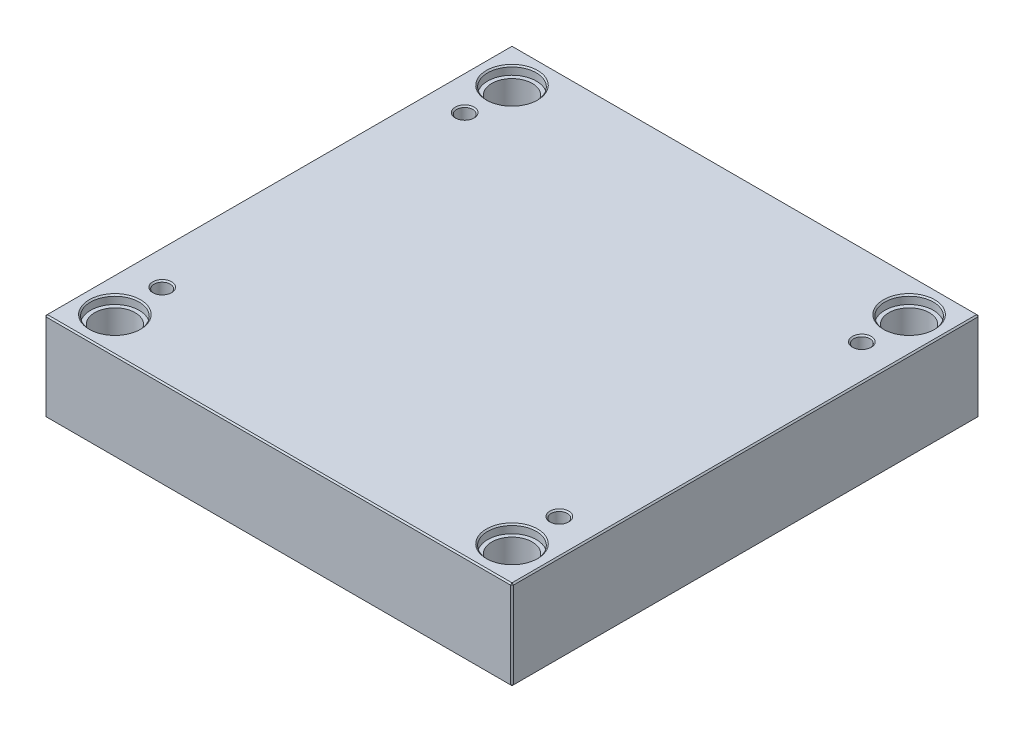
ISO-10303-21;
HEADER;
FILE_DESCRIPTION(('STEP AP214'),'2;1');
FILE_NAME('part.step','',(''),(''),'','','');
FILE_SCHEMA(('AUTOMOTIVE_DESIGN { 1 0 10303 214 1 1 1 1 }'));
ENDSEC;
DATA;
#1=APPLICATION_CONTEXT('core data for automotive mechanical design processes');
#2=APPLICATION_PROTOCOL_DEFINITION('international standard','automotive_design',2000,#1);
#3=PRODUCT_CONTEXT('',#1,'mechanical');
#4=PRODUCT('Part','Part','',(#3));
#5=PRODUCT_RELATED_PRODUCT_CATEGORY('part','',(#4));
#6=PRODUCT_DEFINITION_FORMATION('','',#4);
#7=PRODUCT_DEFINITION_CONTEXT('part definition',#1,'design');
#8=PRODUCT_DEFINITION('design','',#6,#7);
#9=PRODUCT_DEFINITION_SHAPE('','',#8);
#10=(LENGTH_UNIT() NAMED_UNIT(*) SI_UNIT(.MILLI.,.METRE.));
#11=(NAMED_UNIT(*) PLANE_ANGLE_UNIT() SI_UNIT($,.RADIAN.));
#12=(NAMED_UNIT(*) SI_UNIT($,.STERADIAN.) SOLID_ANGLE_UNIT());
#13=UNCERTAINTY_MEASURE_WITH_UNIT(LENGTH_MEASURE(1.E-05),#10,'distance_accuracy_value','');
#14=(GEOMETRIC_REPRESENTATION_CONTEXT(3) GLOBAL_UNCERTAINTY_ASSIGNED_CONTEXT((#13)) GLOBAL_UNIT_ASSIGNED_CONTEXT((#10,
#11,#12)) REPRESENTATION_CONTEXT('',''));
#15=CARTESIAN_POINT('',(0.,0.,0.));
#16=DIRECTION('',(0.,0.,1.));
#17=DIRECTION('',(1.,0.,0.));
#18=AXIS2_PLACEMENT_3D('',#15,#16,#17);
#19=CARTESIAN_POINT('',(-147.,0.,-147.));
#20=DIRECTION('',(0.,1.,0.));
#21=DIRECTION('',(0.,0.,1.));
#22=AXIS2_PLACEMENT_3D('',#19,#20,#21);
#23=CYLINDRICAL_SURFACE('',#22,15.);
#24=CARTESIAN_POINT('',(-147.,0.999999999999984,-147.));
#25=DIRECTION('',(0.,1.,0.));
#26=DIRECTION('',(0.,0.,1.));
#27=AXIS2_PLACEMENT_3D('',#24,#25,#26);
#28=CIRCLE('',#27,15.);
#29=CARTESIAN_POINT('',(-147.,0.999999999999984,-132.));
#30=VERTEX_POINT('',#29);
#31=EDGE_CURVE('E472',#30,#30,#28,.F.);
#32=ORIENTED_EDGE('',*,*,#31,.T.);
#33=EDGE_LOOP('',(#32));
#34=FACE_BOUND('',#33,.T.);
#35=CARTESIAN_POINT('',(-147.,59.7,-147.));
#36=DIRECTION('',(0.,1.,0.));
#37=DIRECTION('',(0.,0.,1.));
#38=AXIS2_PLACEMENT_3D('',#35,#36,#37);
#39=CIRCLE('',#38,15.);
#40=CARTESIAN_POINT('',(-147.,59.7,-132.));
#41=VERTEX_POINT('',#40);
#42=EDGE_CURVE('E221',#41,#41,#39,.F.);
#43=ORIENTED_EDGE('',*,*,#42,.F.);
#44=EDGE_LOOP('',(#43));
#45=FACE_BOUND('',#44,.T.);
#46=ADVANCED_FACE('F16',(#34,#45),#23,.F.);
#47=CARTESIAN_POINT('',(147.,0.,-147.));
#48=DIRECTION('',(0.,1.,0.));
#49=DIRECTION('',(0.,0.,1.));
#50=AXIS2_PLACEMENT_3D('',#47,#48,#49);
#51=CYLINDRICAL_SURFACE('',#50,15.);
#52=CARTESIAN_POINT('',(147.,0.999999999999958,-147.));
#53=DIRECTION('',(0.,1.,0.));
#54=DIRECTION('',(0.,0.,1.));
#55=AXIS2_PLACEMENT_3D('',#52,#53,#54);
#56=CIRCLE('',#55,15.);
#57=CARTESIAN_POINT('',(147.,0.999999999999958,-132.));
#58=VERTEX_POINT('',#57);
#59=EDGE_CURVE('E474',#58,#58,#56,.F.);
#60=ORIENTED_EDGE('',*,*,#59,.T.);
#61=EDGE_LOOP('',(#60));
#62=FACE_BOUND('',#61,.T.);
#63=CARTESIAN_POINT('',(147.,59.7,-147.));
#64=DIRECTION('',(0.,1.,0.));
#65=DIRECTION('',(0.,0.,1.));
#66=AXIS2_PLACEMENT_3D('',#63,#64,#65);
#67=CIRCLE('',#66,15.);
#68=CARTESIAN_POINT('',(147.,59.7,-132.));
#69=VERTEX_POINT('',#68);
#70=EDGE_CURVE('E218',#69,#69,#67,.F.);
#71=ORIENTED_EDGE('',*,*,#70,.F.);
#72=EDGE_LOOP('',(#71));
#73=FACE_BOUND('',#72,.T.);
#74=ADVANCED_FACE('F263',(#62,#73),#51,.F.);
#75=CARTESIAN_POINT('',(147.,0.,147.));
#76=DIRECTION('',(0.,1.,0.));
#77=DIRECTION('',(0.,0.,1.));
#78=AXIS2_PLACEMENT_3D('',#75,#76,#77);
#79=CYLINDRICAL_SURFACE('',#78,15.);
#80=CARTESIAN_POINT('',(147.,0.999999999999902,147.));
#81=DIRECTION('',(0.,1.,0.));
#82=DIRECTION('',(0.,0.,1.));
#83=AXIS2_PLACEMENT_3D('',#80,#81,#82);
#84=CIRCLE('',#83,15.);
#85=CARTESIAN_POINT('',(147.,0.999999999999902,162.));
#86=VERTEX_POINT('',#85);
#87=EDGE_CURVE('E477',#86,#86,#84,.F.);
#88=ORIENTED_EDGE('',*,*,#87,.T.);
#89=EDGE_LOOP('',(#88));
#90=FACE_BOUND('',#89,.T.);
#91=CARTESIAN_POINT('',(147.,59.7,147.));
#92=DIRECTION('',(0.,1.,0.));
#93=DIRECTION('',(0.,0.,1.));
#94=AXIS2_PLACEMENT_3D('',#91,#92,#93);
#95=CIRCLE('',#94,15.);
#96=CARTESIAN_POINT('',(147.,59.7,162.));
#97=VERTEX_POINT('',#96);
#98=EDGE_CURVE('E214',#97,#97,#95,.F.);
#99=ORIENTED_EDGE('',*,*,#98,.F.);
#100=EDGE_LOOP('',(#99));
#101=FACE_BOUND('',#100,.T.);
#102=ADVANCED_FACE('F270',(#90,#101),#79,.F.);
#103=CARTESIAN_POINT('',(-147.,0.,147.));
#104=DIRECTION('',(0.,1.,0.));
#105=DIRECTION('',(0.,0.,1.));
#106=AXIS2_PLACEMENT_3D('',#103,#104,#105);
#107=CYLINDRICAL_SURFACE('',#106,15.);
#108=CARTESIAN_POINT('',(-147.,0.999999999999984,147.));
#109=DIRECTION('',(0.,1.,0.));
#110=DIRECTION('',(0.,0.,1.));
#111=AXIS2_PLACEMENT_3D('',#108,#109,#110);
#112=CIRCLE('',#111,15.);
#113=CARTESIAN_POINT('',(-147.,0.999999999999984,162.));
#114=VERTEX_POINT('',#113);
#115=EDGE_CURVE('E480',#114,#114,#112,.F.);
#116=ORIENTED_EDGE('',*,*,#115,.T.);
#117=EDGE_LOOP('',(#116));
#118=FACE_BOUND('',#117,.T.);
#119=CARTESIAN_POINT('',(-147.,59.7,147.));
#120=DIRECTION('',(0.,1.,0.));
#121=DIRECTION('',(0.,0.,1.));
#122=AXIS2_PLACEMENT_3D('',#119,#120,#121);
#123=CIRCLE('',#122,15.);
#124=CARTESIAN_POINT('',(-147.,59.7,162.));
#125=VERTEX_POINT('',#124);
#126=EDGE_CURVE('E211',#125,#125,#123,.F.);
#127=ORIENTED_EDGE('',*,*,#126,.F.);
#128=EDGE_LOOP('',(#127));
#129=FACE_BOUND('',#128,.T.);
#130=ADVANCED_FACE('F277',(#118,#129),#107,.F.);
#131=CARTESIAN_POINT('',(-173.,66.,173.));
#132=DIRECTION('',(1.,0.,0.));
#133=DIRECTION('',(0.,0.,-1.));
#134=AXIS2_PLACEMENT_3D('',#131,#132,#133);
#135=PLANE('',#134);
#136=DIRECTION('',(0.,-1.,0.));
#137=VECTOR('',#136,1.);
#138=CARTESIAN_POINT('',(-173.,66.,-172.));
#139=LINE('',#138,#137);
#140=CARTESIAN_POINT('',(-173.,65.,-172.));
#141=VERTEX_POINT('',#140);
#142=CARTESIAN_POINT('',(-173.,1.,-172.));
#143=VERTEX_POINT('',#142);
#144=EDGE_CURVE('E487',#141,#143,#139,.T.);
#145=ORIENTED_EDGE('',*,*,#144,.T.);
#146=DIRECTION('',(0.,0.,1.));
#147=VECTOR('',#146,1.);
#148=CARTESIAN_POINT('',(-173.,1.,173.));
#149=LINE('',#148,#147);
#150=CARTESIAN_POINT('',(-173.,1.,172.));
#151=VERTEX_POINT('',#150);
#152=EDGE_CURVE('E490',#143,#151,#149,.T.);
#153=ORIENTED_EDGE('',*,*,#152,.T.);
#154=DIRECTION('',(0.,1.,0.));
#155=VECTOR('',#154,1.);
#156=CARTESIAN_POINT('',(-173.,66.,172.));
#157=LINE('',#156,#155);
#158=CARTESIAN_POINT('',(-173.,65.,172.));
#159=VERTEX_POINT('',#158);
#160=EDGE_CURVE('E485',#151,#159,#157,.T.);
#161=ORIENTED_EDGE('',*,*,#160,.T.);
#162=DIRECTION('',(0.,0.,-1.));
#163=VECTOR('',#162,1.);
#164=CARTESIAN_POINT('',(-173.,65.,-173.));
#165=LINE('',#164,#163);
#166=EDGE_CURVE('E483',#159,#141,#165,.T.);
#167=ORIENTED_EDGE('',*,*,#166,.T.);
#168=EDGE_LOOP('',(#145,#153,#161,#167));
#169=FACE_BOUND('',#168,.T.);
#170=ADVANCED_FACE('F298',(#169),#135,.F.);
#171=CARTESIAN_POINT('',(173.,66.,173.));
#172=DIRECTION('',(0.,0.,-1.));
#173=DIRECTION('',(-1.,0.,0.));
#174=AXIS2_PLACEMENT_3D('',#171,#172,#173);
#175=PLANE('',#174);
#176=DIRECTION('',(-1.,0.,0.));
#177=VECTOR('',#176,1.);
#178=CARTESIAN_POINT('',(-173.,65.,173.));
#179=LINE('',#178,#177);
#180=CARTESIAN_POINT('',(172.,65.,173.));
#181=VERTEX_POINT('',#180);
#182=CARTESIAN_POINT('',(-172.,65.,173.));
#183=VERTEX_POINT('',#182);
#184=EDGE_CURVE('E509',#181,#183,#179,.T.);
#185=ORIENTED_EDGE('',*,*,#184,.T.);
#186=DIRECTION('',(0.,-1.,0.));
#187=VECTOR('',#186,1.);
#188=CARTESIAN_POINT('',(-172.,66.,173.));
#189=LINE('',#188,#187);
#190=CARTESIAN_POINT('',(-172.,1.,173.));
#191=VERTEX_POINT('',#190);
#192=EDGE_CURVE('E515',#183,#191,#189,.T.);
#193=ORIENTED_EDGE('',*,*,#192,.T.);
#194=DIRECTION('',(1.,0.,0.));
#195=VECTOR('',#194,1.);
#196=CARTESIAN_POINT('',(173.,1.,173.));
#197=LINE('',#196,#195);
#198=CARTESIAN_POINT('',(172.,1.,173.));
#199=VERTEX_POINT('',#198);
#200=EDGE_CURVE('E513',#191,#199,#197,.T.);
#201=ORIENTED_EDGE('',*,*,#200,.T.);
#202=DIRECTION('',(0.,1.,0.));
#203=VECTOR('',#202,1.);
#204=CARTESIAN_POINT('',(172.,66.,173.));
#205=LINE('',#204,#203);
#206=EDGE_CURVE('E511',#199,#181,#205,.T.);
#207=ORIENTED_EDGE('',*,*,#206,.T.);
#208=EDGE_LOOP('',(#185,#193,#201,#207));
#209=FACE_BOUND('',#208,.T.);
#210=ADVANCED_FACE('F294',(#209),#175,.F.);
#211=CARTESIAN_POINT('',(173.,66.,173.));
#212=DIRECTION('',(-1.,0.,0.));
#213=DIRECTION('',(0.,0.,1.));
#214=AXIS2_PLACEMENT_3D('',#211,#212,#213);
#215=PLANE('',#214);
#216=DIRECTION('',(0.,0.,-1.));
#217=VECTOR('',#216,1.);
#218=CARTESIAN_POINT('',(173.,1.,173.));
#219=LINE('',#218,#217);
#220=CARTESIAN_POINT('',(173.,1.,172.));
#221=VERTEX_POINT('',#220);
#222=CARTESIAN_POINT('',(173.,1.,-172.));
#223=VERTEX_POINT('',#222);
#224=EDGE_CURVE('E504',#221,#223,#219,.T.);
#225=ORIENTED_EDGE('',*,*,#224,.T.);
#226=DIRECTION('',(0.,1.,0.));
#227=VECTOR('',#226,1.);
#228=CARTESIAN_POINT('',(173.,66.,-172.));
#229=LINE('',#228,#227);
#230=CARTESIAN_POINT('',(173.,65.,-172.));
#231=VERTEX_POINT('',#230);
#232=EDGE_CURVE('E506',#223,#231,#229,.T.);
#233=ORIENTED_EDGE('',*,*,#232,.T.);
#234=DIRECTION('',(0.,0.,1.));
#235=VECTOR('',#234,1.);
#236=CARTESIAN_POINT('',(173.,65.,173.));
#237=LINE('',#236,#235);
#238=CARTESIAN_POINT('',(173.,65.,172.));
#239=VERTEX_POINT('',#238);
#240=EDGE_CURVE('E500',#231,#239,#237,.T.);
#241=ORIENTED_EDGE('',*,*,#240,.T.);
#242=DIRECTION('',(0.,-1.,0.));
#243=VECTOR('',#242,1.);
#244=CARTESIAN_POINT('',(173.,66.,172.));
#245=LINE('',#244,#243);
#246=EDGE_CURVE('E502',#239,#221,#245,.T.);
#247=ORIENTED_EDGE('',*,*,#246,.T.);
#248=EDGE_LOOP('',(#225,#233,#241,#247));
#249=FACE_BOUND('',#248,.T.);
#250=ADVANCED_FACE('F290',(#249),#215,.F.);
#251=CARTESIAN_POINT('',(173.,66.,-173.));
#252=DIRECTION('',(0.,0.,1.));
#253=DIRECTION('',(1.,0.,0.));
#254=AXIS2_PLACEMENT_3D('',#251,#252,#253);
#255=PLANE('',#254);
#256=DIRECTION('',(0.,-1.,0.));
#257=VECTOR('',#256,1.);
#258=CARTESIAN_POINT('',(172.,66.,-173.));
#259=LINE('',#258,#257);
#260=CARTESIAN_POINT('',(172.,65.,-173.));
#261=VERTEX_POINT('',#260);
#262=CARTESIAN_POINT('',(172.,1.,-173.));
#263=VERTEX_POINT('',#262);
#264=EDGE_CURVE('E494',#261,#263,#259,.T.);
#265=ORIENTED_EDGE('',*,*,#264,.T.);
#266=DIRECTION('',(-1.,0.,0.));
#267=VECTOR('',#266,1.);
#268=CARTESIAN_POINT('',(173.,1.,-173.));
#269=LINE('',#268,#267);
#270=CARTESIAN_POINT('',(-172.,1.,-173.));
#271=VERTEX_POINT('',#270);
#272=EDGE_CURVE('E138',#263,#271,#269,.T.);
#273=ORIENTED_EDGE('',*,*,#272,.T.);
#274=DIRECTION('',(0.,1.,0.));
#275=VECTOR('',#274,1.);
#276=CARTESIAN_POINT('',(-172.,66.,-173.));
#277=LINE('',#276,#275);
#278=CARTESIAN_POINT('',(-172.,65.,-173.));
#279=VERTEX_POINT('',#278);
#280=EDGE_CURVE('E496',#271,#279,#277,.T.);
#281=ORIENTED_EDGE('',*,*,#280,.T.);
#282=DIRECTION('',(1.,0.,0.));
#283=VECTOR('',#282,1.);
#284=CARTESIAN_POINT('',(173.,65.,-173.));
#285=LINE('',#284,#283);
#286=EDGE_CURVE('E492',#279,#261,#285,.T.);
#287=ORIENTED_EDGE('',*,*,#286,.T.);
#288=EDGE_LOOP('',(#265,#273,#281,#287));
#289=FACE_BOUND('',#288,.T.);
#290=ADVANCED_FACE('F282',(#289),#255,.F.);
#291=CARTESIAN_POINT('',(0.,66.,0.));
#292=DIRECTION('',(0.,1.,0.));
#293=DIRECTION('',(0.,0.,1.));
#294=AXIS2_PLACEMENT_3D('',#291,#292,#293);
#295=PLANE('',#294);
#296=CARTESIAN_POINT('',(147.,66.,147.));
#297=DIRECTION('',(0.,1.,0.));
#298=DIRECTION('',(0.,0.,1.));
#299=AXIS2_PLACEMENT_3D('',#296,#297,#298);
#300=CIRCLE('',#299,19.);
#301=CARTESIAN_POINT('',(147.,66.,166.));
#302=VERTEX_POINT('',#301);
#303=EDGE_CURVE('E236',#302,#302,#300,.F.);
#304=ORIENTED_EDGE('',*,*,#303,.T.);
#305=EDGE_LOOP('',(#304));
#306=FACE_BOUND('',#305,.T.);
#307=CARTESIAN_POINT('',(-147.,66.,147.));
#308=DIRECTION('',(0.,1.,0.));
#309=DIRECTION('',(0.,0.,1.));
#310=AXIS2_PLACEMENT_3D('',#307,#308,#309);
#311=CIRCLE('',#310,19.);
#312=CARTESIAN_POINT('',(-147.,66.,166.));
#313=VERTEX_POINT('',#312);
#314=EDGE_CURVE('E233',#313,#313,#311,.F.);
#315=ORIENTED_EDGE('',*,*,#314,.T.);
#316=EDGE_LOOP('',(#315));
#317=FACE_BOUND('',#316,.T.);
#318=CARTESIAN_POINT('',(147.,66.,-147.));
#319=DIRECTION('',(0.,1.,0.));
#320=DIRECTION('',(0.,0.,1.));
#321=AXIS2_PLACEMENT_3D('',#318,#319,#320);
#322=CIRCLE('',#321,19.);
#323=CARTESIAN_POINT('',(147.,66.,-128.));
#324=VERTEX_POINT('',#323);
#325=EDGE_CURVE('E230',#324,#324,#322,.F.);
#326=ORIENTED_EDGE('',*,*,#325,.T.);
#327=EDGE_LOOP('',(#326));
#328=FACE_BOUND('',#327,.T.);
#329=CARTESIAN_POINT('',(-147.,66.,-147.));
#330=DIRECTION('',(0.,1.,0.));
#331=DIRECTION('',(0.,0.,1.));
#332=AXIS2_PLACEMENT_3D('',#329,#330,#331);
#333=CIRCLE('',#332,19.);
#334=CARTESIAN_POINT('',(-147.,66.,-128.));
#335=VERTEX_POINT('',#334);
#336=EDGE_CURVE('E227',#335,#335,#333,.F.);
#337=ORIENTED_EDGE('',*,*,#336,.T.);
#338=EDGE_LOOP('',(#337));
#339=FACE_BOUND('',#338,.T.);
#340=CARTESIAN_POINT('',(-147.,66.,112.));
#341=DIRECTION('',(0.,1.,0.));
#342=DIRECTION('',(0.,0.,1.));
#343=AXIS2_PLACEMENT_3D('',#340,#341,#342);
#344=CIRCLE('',#343,7.);
#345=CARTESIAN_POINT('',(-147.,66.,119.));
#346=VERTEX_POINT('',#345);
#347=EDGE_CURVE('E198',#346,#346,#344,.F.);
#348=ORIENTED_EDGE('',*,*,#347,.T.);
#349=EDGE_LOOP('',(#348));
#350=FACE_BOUND('',#349,.T.);
#351=CARTESIAN_POINT('',(147.,66.,112.));
#352=DIRECTION('',(0.,1.,0.));
#353=DIRECTION('',(0.,0.,1.));
#354=AXIS2_PLACEMENT_3D('',#351,#352,#353);
#355=CIRCLE('',#354,7.);
#356=CARTESIAN_POINT('',(147.,66.,119.));
#357=VERTEX_POINT('',#356);
#358=EDGE_CURVE('E195',#357,#357,#355,.F.);
#359=ORIENTED_EDGE('',*,*,#358,.T.);
#360=EDGE_LOOP('',(#359));
#361=FACE_BOUND('',#360,.T.);
#362=CARTESIAN_POINT('',(147.,66.,-112.));
#363=DIRECTION('',(0.,1.,0.));
#364=DIRECTION('',(0.,0.,1.));
#365=AXIS2_PLACEMENT_3D('',#362,#363,#364);
#366=CIRCLE('',#365,7.);
#367=CARTESIAN_POINT('',(147.,66.,-105.));
#368=VERTEX_POINT('',#367);
#369=EDGE_CURVE('E192',#368,#368,#366,.F.);
#370=ORIENTED_EDGE('',*,*,#369,.T.);
#371=EDGE_LOOP('',(#370));
#372=FACE_BOUND('',#371,.T.);
#373=CARTESIAN_POINT('',(-147.,66.,-112.));
#374=DIRECTION('',(0.,1.,0.));
#375=DIRECTION('',(0.,0.,1.));
#376=AXIS2_PLACEMENT_3D('',#373,#374,#375);
#377=CIRCLE('',#376,7.);
#378=CARTESIAN_POINT('',(-147.,66.,-105.));
#379=VERTEX_POINT('',#378);
#380=EDGE_CURVE('E188',#379,#379,#377,.F.);
#381=ORIENTED_EDGE('',*,*,#380,.T.);
#382=EDGE_LOOP('',(#381));
#383=FACE_BOUND('',#382,.T.);
#384=DIRECTION('',(0.,0.,-1.));
#385=VECTOR('',#384,1.);
#386=CARTESIAN_POINT('',(172.,66.,-173.));
#387=LINE('',#386,#385);
#388=CARTESIAN_POINT('',(172.,66.,172.));
#389=VERTEX_POINT('',#388);
#390=CARTESIAN_POINT('',(172.,66.,-172.));
#391=VERTEX_POINT('',#390);
#392=EDGE_CURVE('E31',#389,#391,#387,.T.);
#393=ORIENTED_EDGE('',*,*,#392,.T.);
#394=DIRECTION('',(-1.,0.,0.));
#395=VECTOR('',#394,1.);
#396=CARTESIAN_POINT('',(-173.,66.,-172.));
#397=LINE('',#396,#395);
#398=CARTESIAN_POINT('',(-172.,66.,-172.));
#399=VERTEX_POINT('',#398);
#400=EDGE_CURVE('E189',#391,#399,#397,.T.);
#401=ORIENTED_EDGE('',*,*,#400,.T.);
#402=DIRECTION('',(0.,0.,1.));
#403=VECTOR('',#402,1.);
#404=CARTESIAN_POINT('',(-172.,66.,173.));
#405=LINE('',#404,#403);
#406=CARTESIAN_POINT('',(-172.,66.,172.));
#407=VERTEX_POINT('',#406);
#408=EDGE_CURVE('E518',#399,#407,#405,.T.);
#409=ORIENTED_EDGE('',*,*,#408,.T.);
#410=DIRECTION('',(1.,0.,0.));
#411=VECTOR('',#410,1.);
#412=CARTESIAN_POINT('',(173.,66.,172.));
#413=LINE('',#412,#411);
#414=EDGE_CURVE('E36',#407,#389,#413,.T.);
#415=ORIENTED_EDGE('',*,*,#414,.T.);
#416=EDGE_LOOP('',(#393,#401,#409,#415));
#417=FACE_BOUND('',#416,.T.);
#418=ADVANCED_FACE('F279',(#306,#317,#328,#339,#350,#361,#372,#383,#417),#295,.T.);
#419=CARTESIAN_POINT('',(0.,0.,0.));
#420=DIRECTION('',(0.,1.,0.));
#421=DIRECTION('',(0.,0.,1.));
#422=AXIS2_PLACEMENT_3D('',#419,#420,#421);
#423=PLANE('',#422);
#424=CARTESIAN_POINT('',(-147.,0.,-147.));
#425=DIRECTION('',(0.,1.,0.));
#426=DIRECTION('',(0.,0.,1.));
#427=AXIS2_PLACEMENT_3D('',#424,#425,#426);
#428=CIRCLE('',#427,16.);
#429=CARTESIAN_POINT('',(-147.,0.,-131.));
#430=VERTEX_POINT('',#429);
#431=EDGE_CURVE('E469',#430,#430,#428,.T.);
#432=ORIENTED_EDGE('',*,*,#431,.T.);
#433=EDGE_LOOP('',(#432));
#434=FACE_BOUND('',#433,.T.);
#435=CARTESIAN_POINT('',(147.,0.,-147.));
#436=DIRECTION('',(0.,1.,0.));
#437=DIRECTION('',(0.,0.,1.));
#438=AXIS2_PLACEMENT_3D('',#435,#436,#437);
#439=CIRCLE('',#438,16.);
#440=CARTESIAN_POINT('',(147.,0.,-131.));
#441=VERTEX_POINT('',#440);
#442=EDGE_CURVE('E466',#441,#441,#439,.T.);
#443=ORIENTED_EDGE('',*,*,#442,.T.);
#444=EDGE_LOOP('',(#443));
#445=FACE_BOUND('',#444,.T.);
#446=CARTESIAN_POINT('',(147.,0.,147.));
#447=DIRECTION('',(0.,1.,0.));
#448=DIRECTION('',(0.,0.,1.));
#449=AXIS2_PLACEMENT_3D('',#446,#447,#448);
#450=CIRCLE('',#449,16.);
#451=CARTESIAN_POINT('',(147.,0.,163.));
#452=VERTEX_POINT('',#451);
#453=EDGE_CURVE('E463',#452,#452,#450,.T.);
#454=ORIENTED_EDGE('',*,*,#453,.T.);
#455=EDGE_LOOP('',(#454));
#456=FACE_BOUND('',#455,.T.);
#457=CARTESIAN_POINT('',(-147.,0.,147.));
#458=DIRECTION('',(0.,1.,0.));
#459=DIRECTION('',(0.,0.,1.));
#460=AXIS2_PLACEMENT_3D('',#457,#458,#459);
#461=CIRCLE('',#460,16.);
#462=CARTESIAN_POINT('',(-147.,0.,163.));
#463=VERTEX_POINT('',#462);
#464=EDGE_CURVE('E460',#463,#463,#461,.T.);
#465=ORIENTED_EDGE('',*,*,#464,.T.);
#466=EDGE_LOOP('',(#465));
#467=FACE_BOUND('',#466,.T.);
#468=DIRECTION('',(0.,0.,1.));
#469=VECTOR('',#468,1.);
#470=CARTESIAN_POINT('',(172.,0.,0.));
#471=LINE('',#470,#469);
#472=CARTESIAN_POINT('',(172.,0.,-172.));
#473=VERTEX_POINT('',#472);
#474=CARTESIAN_POINT('',(172.,0.,172.));
#475=VERTEX_POINT('',#474);
#476=EDGE_CURVE('E108',#473,#475,#471,.T.);
#477=ORIENTED_EDGE('',*,*,#476,.T.);
#478=DIRECTION('',(-1.,0.,0.));
#479=VECTOR('',#478,1.);
#480=CARTESIAN_POINT('',(0.,0.,172.));
#481=LINE('',#480,#479);
#482=CARTESIAN_POINT('',(-172.,0.,172.));
#483=VERTEX_POINT('',#482);
#484=EDGE_CURVE('E458',#475,#483,#481,.T.);
#485=ORIENTED_EDGE('',*,*,#484,.T.);
#486=DIRECTION('',(0.,0.,-1.));
#487=VECTOR('',#486,1.);
#488=CARTESIAN_POINT('',(-172.,0.,0.));
#489=LINE('',#488,#487);
#490=CARTESIAN_POINT('',(-172.,0.,-172.));
#491=VERTEX_POINT('',#490);
#492=EDGE_CURVE('E110',#483,#491,#489,.T.);
#493=ORIENTED_EDGE('',*,*,#492,.T.);
#494=DIRECTION('',(1.,0.,0.));
#495=VECTOR('',#494,1.);
#496=CARTESIAN_POINT('',(0.,0.,-172.));
#497=LINE('',#496,#495);
#498=EDGE_CURVE('E104',#491,#473,#497,.T.);
#499=ORIENTED_EDGE('',*,*,#498,.T.);
#500=EDGE_LOOP('',(#477,#485,#493,#499));
#501=FACE_BOUND('',#500,.T.);
#502=ADVANCED_FACE('F106',(#434,#445,#456,#467,#501),#423,.F.);
#503=CARTESIAN_POINT('',(-147.,0.,-147.));
#504=DIRECTION('',(0.,-1.,0.));
#505=DIRECTION('',(0.,0.,-1.));
#506=AXIS2_PLACEMENT_3D('',#503,#504,#505);
#507=CONICAL_SURFACE('',#506,16.,0.785398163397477);
#508=ORIENTED_EDGE('',*,*,#31,.F.);
#509=EDGE_LOOP('',(#508));
#510=FACE_BOUND('',#509,.T.);
#511=ORIENTED_EDGE('',*,*,#431,.F.);
#512=EDGE_LOOP('',(#511));
#513=FACE_BOUND('',#512,.T.);
#514=ADVANCED_FACE('F286',(#510,#513),#507,.F.);
#515=CARTESIAN_POINT('',(147.,0.,-147.));
#516=DIRECTION('',(0.,-1.,0.));
#517=DIRECTION('',(0.,0.,-1.));
#518=AXIS2_PLACEMENT_3D('',#515,#516,#517);
#519=CONICAL_SURFACE('',#518,16.,0.785398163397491);
#520=ORIENTED_EDGE('',*,*,#59,.F.);
#521=EDGE_LOOP('',(#520));
#522=FACE_BOUND('',#521,.T.);
#523=ORIENTED_EDGE('',*,*,#442,.F.);
#524=EDGE_LOOP('',(#523));
#525=FACE_BOUND('',#524,.T.);
#526=ADVANCED_FACE('F305',(#522,#525),#519,.F.);
#527=CARTESIAN_POINT('',(147.,0.,147.));
#528=DIRECTION('',(0.,-1.,0.));
#529=DIRECTION('',(0.,0.,-1.));
#530=AXIS2_PLACEMENT_3D('',#527,#528,#529);
#531=CONICAL_SURFACE('',#530,16.,0.78539816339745);
#532=ORIENTED_EDGE('',*,*,#87,.F.);
#533=EDGE_LOOP('',(#532));
#534=FACE_BOUND('',#533,.T.);
#535=ORIENTED_EDGE('',*,*,#453,.F.);
#536=EDGE_LOOP('',(#535));
#537=FACE_BOUND('',#536,.T.);
#538=ADVANCED_FACE('F309',(#534,#537),#531,.F.);
#539=CARTESIAN_POINT('',(-147.,0.,147.));
#540=DIRECTION('',(0.,-1.,0.));
#541=DIRECTION('',(0.,0.,-1.));
#542=AXIS2_PLACEMENT_3D('',#539,#540,#541);
#543=CONICAL_SURFACE('',#542,16.,0.785398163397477);
#544=ORIENTED_EDGE('',*,*,#115,.F.);
#545=EDGE_LOOP('',(#544));
#546=FACE_BOUND('',#545,.T.);
#547=ORIENTED_EDGE('',*,*,#464,.F.);
#548=EDGE_LOOP('',(#547));
#549=FACE_BOUND('',#548,.T.);
#550=ADVANCED_FACE('F313',(#546,#549),#543,.F.);
#551=CARTESIAN_POINT('',(173.,66.,172.));
#552=DIRECTION('',(-0.707106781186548,0.,-0.707106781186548));
#553=DIRECTION('',(0.,-1.,0.));
#554=AXIS2_PLACEMENT_3D('',#551,#552,#553);
#555=PLANE('',#554);
#556=DIRECTION('',(-0.707106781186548,0.,0.707106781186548));
#557=VECTOR('',#556,1.);
#558=CARTESIAN_POINT('',(172.,65.,173.));
#559=LINE('',#558,#557);
#560=EDGE_CURVE('E126',#181,#239,#559,.F.);
#561=ORIENTED_EDGE('',*,*,#560,.F.);
#562=ORIENTED_EDGE('',*,*,#206,.F.);
#563=DIRECTION('',(0.707106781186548,0.,-0.707106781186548));
#564=VECTOR('',#563,1.);
#565=CARTESIAN_POINT('',(172.,1.,173.));
#566=LINE('',#565,#564);
#567=EDGE_CURVE('E180',#221,#199,#566,.F.);
#568=ORIENTED_EDGE('',*,*,#567,.F.);
#569=ORIENTED_EDGE('',*,*,#246,.F.);
#570=EDGE_LOOP('',(#561,#562,#568,#569));
#571=FACE_BOUND('',#570,.T.);
#572=ADVANCED_FACE('F317',(#571),#555,.F.);
#573=CARTESIAN_POINT('',(172.,65.,173.));
#574=DIRECTION('',(0.57735026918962,0.577350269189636,0.57735026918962));
#575=DIRECTION('',(0.,-0.707106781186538,0.707106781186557));
#576=AXIS2_PLACEMENT_3D('',#573,#574,#575);
#577=PLANE('',#576);
#578=DIRECTION('',(0.,-0.707106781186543,0.707106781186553));
#579=VECTOR('',#578,1.);
#580=CARTESIAN_POINT('',(172.,65.,173.));
#581=LINE('',#580,#579);
#582=EDGE_CURVE('E175',#181,#389,#581,.F.);
#583=ORIENTED_EDGE('',*,*,#582,.F.);
#584=ORIENTED_EDGE('',*,*,#560,.T.);
#585=DIRECTION('',(-0.707106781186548,0.707106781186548,0.));
#586=VECTOR('',#585,1.);
#587=CARTESIAN_POINT('',(172.5,65.5,172.));
#588=LINE('',#587,#586);
#589=EDGE_CURVE('E177',#389,#239,#588,.F.);
#590=ORIENTED_EDGE('',*,*,#589,.F.);
#591=EDGE_LOOP('',(#583,#584,#590));
#592=FACE_BOUND('',#591,.T.);
#593=ADVANCED_FACE('F385',(#592),#577,.T.);
#594=CARTESIAN_POINT('',(172.,1.,173.));
#595=DIRECTION('',(0.57735026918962,-0.577350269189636,0.57735026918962));
#596=DIRECTION('',(0.,-0.707106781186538,-0.707106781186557));
#597=AXIS2_PLACEMENT_3D('',#594,#595,#596);
#598=PLANE('',#597);
#599=DIRECTION('',(-0.707106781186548,-0.707106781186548,0.));
#600=VECTOR('',#599,1.);
#601=CARTESIAN_POINT('',(172.5,0.500000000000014,172.));
#602=LINE('',#601,#600);
#603=EDGE_CURVE('E124',#221,#475,#602,.T.);
#604=ORIENTED_EDGE('',*,*,#603,.F.);
#605=ORIENTED_EDGE('',*,*,#567,.T.);
#606=DIRECTION('',(0.,0.707106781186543,0.707106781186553));
#607=VECTOR('',#606,1.);
#608=CARTESIAN_POINT('',(172.,1.,173.));
#609=LINE('',#608,#607);
#610=EDGE_CURVE('E172',#475,#199,#609,.T.);
#611=ORIENTED_EDGE('',*,*,#610,.F.);
#612=EDGE_LOOP('',(#604,#605,#611));
#613=FACE_BOUND('',#612,.T.);
#614=ADVANCED_FACE('F381',(#613),#598,.T.);
#615=CARTESIAN_POINT('',(172.,66.,0.));
#616=DIRECTION('',(0.707106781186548,0.707106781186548,0.));
#617=DIRECTION('',(0.,0.,1.));
#618=AXIS2_PLACEMENT_3D('',#615,#616,#617);
#619=PLANE('',#618);
#620=ORIENTED_EDGE('',*,*,#589,.T.);
#621=ORIENTED_EDGE('',*,*,#240,.F.);
#622=DIRECTION('',(0.707106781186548,-0.707106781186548,0.));
#623=VECTOR('',#622,1.);
#624=CARTESIAN_POINT('',(173.,65.,-172.));
#625=LINE('',#624,#623);
#626=EDGE_CURVE('E166',#391,#231,#625,.T.);
#627=ORIENTED_EDGE('',*,*,#626,.F.);
#628=ORIENTED_EDGE('',*,*,#392,.F.);
#629=EDGE_LOOP('',(#620,#621,#627,#628));
#630=FACE_BOUND('',#629,.T.);
#631=ADVANCED_FACE('F377',(#630),#619,.T.);
#632=CARTESIAN_POINT('',(0.,66.,172.));
#633=DIRECTION('',(0.,0.707106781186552,0.707106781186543));
#634=DIRECTION('',(-1.,0.,0.));
#635=AXIS2_PLACEMENT_3D('',#632,#633,#634);
#636=PLANE('',#635);
#637=ORIENTED_EDGE('',*,*,#582,.T.);
#638=ORIENTED_EDGE('',*,*,#414,.F.);
#639=DIRECTION('',(0.,0.707106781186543,-0.707106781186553));
#640=VECTOR('',#639,1.);
#641=CARTESIAN_POINT('',(-172.,65.5,172.5));
#642=LINE('',#641,#640);
#643=EDGE_CURVE('E163',#183,#407,#642,.T.);
#644=ORIENTED_EDGE('',*,*,#643,.F.);
#645=ORIENTED_EDGE('',*,*,#184,.F.);
#646=EDGE_LOOP('',(#637,#638,#644,#645));
#647=FACE_BOUND('',#646,.T.);
#648=ADVANCED_FACE('F373',(#647),#636,.T.);
#649=CARTESIAN_POINT('',(-172.,66.,173.));
#650=DIRECTION('',(0.707106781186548,0.,-0.707106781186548));
#651=DIRECTION('',(0.,-1.,0.));
#652=AXIS2_PLACEMENT_3D('',#649,#650,#651);
#653=PLANE('',#652);
#654=DIRECTION('',(0.707106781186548,0.,0.707106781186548));
#655=VECTOR('',#654,1.);
#656=CARTESIAN_POINT('',(-172.,1.,173.));
#657=LINE('',#656,#655);
#658=EDGE_CURVE('E157',#191,#151,#657,.F.);
#659=ORIENTED_EDGE('',*,*,#658,.F.);
#660=ORIENTED_EDGE('',*,*,#192,.F.);
#661=DIRECTION('',(-0.707106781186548,0.,-0.707106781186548));
#662=VECTOR('',#661,1.);
#663=CARTESIAN_POINT('',(-173.,65.,172.));
#664=LINE('',#663,#662);
#665=EDGE_CURVE('E160',#159,#183,#664,.F.);
#666=ORIENTED_EDGE('',*,*,#665,.F.);
#667=ORIENTED_EDGE('',*,*,#160,.F.);
#668=EDGE_LOOP('',(#659,#660,#666,#667));
#669=FACE_BOUND('',#668,.T.);
#670=ADVANCED_FACE('F369',(#669),#653,.F.);
#671=CARTESIAN_POINT('',(173.,1.,173.));
#672=DIRECTION('',(0.,0.707106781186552,-0.707106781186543));
#673=DIRECTION('',(1.,0.,0.));
#674=AXIS2_PLACEMENT_3D('',#671,#672,#673);
#675=PLANE('',#674);
#676=ORIENTED_EDGE('',*,*,#610,.T.);
#677=ORIENTED_EDGE('',*,*,#200,.F.);
#678=DIRECTION('',(0.,-0.707106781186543,-0.707106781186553));
#679=VECTOR('',#678,1.);
#680=CARTESIAN_POINT('',(-172.,1.,173.));
#681=LINE('',#680,#679);
#682=EDGE_CURVE('E135',#483,#191,#681,.F.);
#683=ORIENTED_EDGE('',*,*,#682,.F.);
#684=ORIENTED_EDGE('',*,*,#484,.F.);
#685=EDGE_LOOP('',(#676,#677,#683,#684));
#686=FACE_BOUND('',#685,.T.);
#687=ADVANCED_FACE('F366',(#686),#675,.F.);
#688=CARTESIAN_POINT('',(173.,1.,173.));
#689=DIRECTION('',(-0.707106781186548,0.707106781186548,0.));
#690=DIRECTION('',(0.,0.,-1.));
#691=AXIS2_PLACEMENT_3D('',#688,#689,#690);
#692=PLANE('',#691);
#693=ORIENTED_EDGE('',*,*,#603,.T.);
#694=ORIENTED_EDGE('',*,*,#476,.F.);
#695=DIRECTION('',(0.707106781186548,0.707106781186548,0.));
#696=VECTOR('',#695,1.);
#697=CARTESIAN_POINT('',(172.5,0.500000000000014,-172.));
#698=LINE('',#697,#696);
#699=EDGE_CURVE('E121',#223,#473,#698,.F.);
#700=ORIENTED_EDGE('',*,*,#699,.F.);
#701=ORIENTED_EDGE('',*,*,#224,.F.);
#702=EDGE_LOOP('',(#693,#694,#700,#701));
#703=FACE_BOUND('',#702,.T.);
#704=ADVANCED_FACE('F119',(#703),#692,.F.);
#705=CARTESIAN_POINT('',(172.,66.,-173.));
#706=DIRECTION('',(-0.707106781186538,0.,0.707106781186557));
#707=DIRECTION('',(0.,-1.,0.));
#708=AXIS2_PLACEMENT_3D('',#705,#706,#707);
#709=PLANE('',#708);
#710=DIRECTION('',(0.707106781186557,0.,0.707106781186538));
#711=VECTOR('',#710,1.);
#712=CARTESIAN_POINT('',(173.,65.,-172.));
#713=LINE('',#712,#711);
#714=EDGE_CURVE('E168',#231,#261,#713,.F.);
#715=ORIENTED_EDGE('',*,*,#714,.F.);
#716=ORIENTED_EDGE('',*,*,#232,.F.);
#717=DIRECTION('',(-0.707106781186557,0.,-0.707106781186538));
#718=VECTOR('',#717,1.);
#719=CARTESIAN_POINT('',(172.,1.,-173.));
#720=LINE('',#719,#718);
#721=EDGE_CURVE('E134',#263,#223,#720,.F.);
#722=ORIENTED_EDGE('',*,*,#721,.F.);
#723=ORIENTED_EDGE('',*,*,#264,.F.);
#724=EDGE_LOOP('',(#715,#716,#722,#723));
#725=FACE_BOUND('',#724,.T.);
#726=ADVANCED_FACE('F359',(#725),#709,.F.);
#727=CARTESIAN_POINT('',(173.,65.,-172.));
#728=DIRECTION('',(0.577350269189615,0.577350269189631,-0.577350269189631));
#729=DIRECTION('',(0.,0.707106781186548,0.707106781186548));
#730=AXIS2_PLACEMENT_3D('',#727,#728,#729);
#731=PLANE('',#730);
#732=ORIENTED_EDGE('',*,*,#626,.T.);
#733=ORIENTED_EDGE('',*,*,#714,.T.);
#734=DIRECTION('',(0.,0.707106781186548,0.707106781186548));
#735=VECTOR('',#734,1.);
#736=CARTESIAN_POINT('',(172.,65.5,-172.5));
#737=LINE('',#736,#735);
#738=EDGE_CURVE('E152',#391,#261,#737,.F.);
#739=ORIENTED_EDGE('',*,*,#738,.F.);
#740=EDGE_LOOP('',(#732,#733,#739));
#741=FACE_BOUND('',#740,.T.);
#742=ADVANCED_FACE('F355',(#741),#731,.T.);
#743=CARTESIAN_POINT('',(-173.,65.,172.));
#744=DIRECTION('',(-0.57735026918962,0.577350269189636,0.57735026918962));
#745=DIRECTION('',(0.,-0.707106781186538,0.707106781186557));
#746=AXIS2_PLACEMENT_3D('',#743,#744,#745);
#747=PLANE('',#746);
#748=ORIENTED_EDGE('',*,*,#665,.T.);
#749=ORIENTED_EDGE('',*,*,#643,.T.);
#750=DIRECTION('',(-0.707106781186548,-0.707106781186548,0.));
#751=VECTOR('',#750,1.);
#752=CARTESIAN_POINT('',(-173.,65.,172.));
#753=LINE('',#752,#751);
#754=EDGE_CURVE('E143',#159,#407,#753,.F.);
#755=ORIENTED_EDGE('',*,*,#754,.F.);
#756=EDGE_LOOP('',(#748,#749,#755));
#757=FACE_BOUND('',#756,.T.);
#758=ADVANCED_FACE('F351',(#757),#747,.T.);
#759=CARTESIAN_POINT('',(-172.,1.,173.));
#760=DIRECTION('',(-0.57735026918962,-0.577350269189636,0.57735026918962));
#761=DIRECTION('',(0.,-0.707106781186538,-0.707106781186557));
#762=AXIS2_PLACEMENT_3D('',#759,#760,#761);
#763=PLANE('',#762);
#764=ORIENTED_EDGE('',*,*,#682,.T.);
#765=ORIENTED_EDGE('',*,*,#658,.T.);
#766=DIRECTION('',(-0.707106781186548,0.707106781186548,0.));
#767=VECTOR('',#766,1.);
#768=CARTESIAN_POINT('',(-172.5,0.500000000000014,172.));
#769=LINE('',#768,#767);
#770=EDGE_CURVE('E139',#483,#151,#769,.T.);
#771=ORIENTED_EDGE('',*,*,#770,.F.);
#772=EDGE_LOOP('',(#764,#765,#771));
#773=FACE_BOUND('',#772,.T.);
#774=ADVANCED_FACE('F348',(#773),#763,.T.);
#775=CARTESIAN_POINT('',(172.,1.,-173.));
#776=DIRECTION('',(0.577350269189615,-0.577350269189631,-0.577350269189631));
#777=DIRECTION('',(0.,0.707106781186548,-0.707106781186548));
#778=AXIS2_PLACEMENT_3D('',#775,#776,#777);
#779=PLANE('',#778);
#780=ORIENTED_EDGE('',*,*,#721,.T.);
#781=ORIENTED_EDGE('',*,*,#699,.T.);
#782=DIRECTION('',(0.,-0.707106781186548,0.707106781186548));
#783=VECTOR('',#782,1.);
#784=CARTESIAN_POINT('',(172.,1.,-173.));
#785=LINE('',#784,#783);
#786=EDGE_CURVE('E131',#263,#473,#785,.T.);
#787=ORIENTED_EDGE('',*,*,#786,.F.);
#788=EDGE_LOOP('',(#780,#781,#787));
#789=FACE_BOUND('',#788,.T.);
#790=ADVANCED_FACE('F130',(#789),#779,.T.);
#791=CARTESIAN_POINT('',(0.,66.,-172.));
#792=DIRECTION('',(0.,0.707106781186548,-0.707106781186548));
#793=DIRECTION('',(1.,0.,0.));
#794=AXIS2_PLACEMENT_3D('',#791,#792,#793);
#795=PLANE('',#794);
#796=ORIENTED_EDGE('',*,*,#738,.T.);
#797=ORIENTED_EDGE('',*,*,#286,.F.);
#798=DIRECTION('',(0.,-0.707106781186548,-0.707106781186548));
#799=VECTOR('',#798,1.);
#800=CARTESIAN_POINT('',(-172.,65.,-173.));
#801=LINE('',#800,#799);
#802=EDGE_CURVE('E140',#399,#279,#801,.T.);
#803=ORIENTED_EDGE('',*,*,#802,.F.);
#804=ORIENTED_EDGE('',*,*,#400,.F.);
#805=EDGE_LOOP('',(#796,#797,#803,#804));
#806=FACE_BOUND('',#805,.T.);
#807=ADVANCED_FACE('F341',(#806),#795,.T.);
#808=CARTESIAN_POINT('',(-172.,66.,0.));
#809=DIRECTION('',(-0.707106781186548,0.707106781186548,0.));
#810=DIRECTION('',(0.,0.,-1.));
#811=AXIS2_PLACEMENT_3D('',#808,#809,#810);
#812=PLANE('',#811);
#813=ORIENTED_EDGE('',*,*,#754,.T.);
#814=ORIENTED_EDGE('',*,*,#408,.F.);
#815=DIRECTION('',(0.707106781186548,0.707106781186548,0.));
#816=VECTOR('',#815,1.);
#817=CARTESIAN_POINT('',(-172.5,65.5,-172.));
#818=LINE('',#817,#816);
#819=EDGE_CURVE('E146',#141,#399,#818,.T.);
#820=ORIENTED_EDGE('',*,*,#819,.F.);
#821=ORIENTED_EDGE('',*,*,#166,.F.);
#822=EDGE_LOOP('',(#813,#814,#820,#821));
#823=FACE_BOUND('',#822,.T.);
#824=ADVANCED_FACE('F337',(#823),#812,.T.);
#825=CARTESIAN_POINT('',(-173.,1.,173.));
#826=DIRECTION('',(0.707106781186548,0.707106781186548,0.));
#827=DIRECTION('',(0.,0.,1.));
#828=AXIS2_PLACEMENT_3D('',#825,#826,#827);
#829=PLANE('',#828);
#830=ORIENTED_EDGE('',*,*,#770,.T.);
#831=ORIENTED_EDGE('',*,*,#152,.F.);
#832=DIRECTION('',(0.707106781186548,-0.707106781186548,0.));
#833=VECTOR('',#832,1.);
#834=CARTESIAN_POINT('',(-173.,1.,-172.));
#835=LINE('',#834,#833);
#836=EDGE_CURVE('E529',#491,#143,#835,.F.);
#837=ORIENTED_EDGE('',*,*,#836,.F.);
#838=ORIENTED_EDGE('',*,*,#492,.F.);
#839=EDGE_LOOP('',(#830,#831,#837,#838));
#840=FACE_BOUND('',#839,.T.);
#841=ADVANCED_FACE('F334',(#840),#829,.F.);
#842=CARTESIAN_POINT('',(173.,1.,-173.));
#843=DIRECTION('',(0.,0.707106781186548,0.707106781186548));
#844=DIRECTION('',(-1.,0.,0.));
#845=AXIS2_PLACEMENT_3D('',#842,#843,#844);
#846=PLANE('',#845);
#847=ORIENTED_EDGE('',*,*,#786,.T.);
#848=ORIENTED_EDGE('',*,*,#498,.F.);
#849=DIRECTION('',(0.,0.707106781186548,-0.707106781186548));
#850=VECTOR('',#849,1.);
#851=CARTESIAN_POINT('',(-172.,0.5,-172.5));
#852=LINE('',#851,#850);
#853=EDGE_CURVE('E526',#271,#491,#852,.F.);
#854=ORIENTED_EDGE('',*,*,#853,.F.);
#855=ORIENTED_EDGE('',*,*,#272,.F.);
#856=EDGE_LOOP('',(#847,#848,#854,#855));
#857=FACE_BOUND('',#856,.T.);
#858=ADVANCED_FACE('F137',(#857),#846,.F.);
#859=CARTESIAN_POINT('',(-172.,65.,-173.));
#860=DIRECTION('',(-0.577350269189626,0.577350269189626,-0.577350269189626));
#861=DIRECTION('',(-0.707106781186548,0.,0.707106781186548));
#862=AXIS2_PLACEMENT_3D('',#859,#860,#861);
#863=PLANE('',#862);
#864=ORIENTED_EDGE('',*,*,#819,.T.);
#865=ORIENTED_EDGE('',*,*,#802,.T.);
#866=DIRECTION('',(0.707106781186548,0.,-0.707106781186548));
#867=VECTOR('',#866,1.);
#868=CARTESIAN_POINT('',(-172.,65.,-173.));
#869=LINE('',#868,#867);
#870=EDGE_CURVE('E524',#141,#279,#869,.T.);
#871=ORIENTED_EDGE('',*,*,#870,.F.);
#872=EDGE_LOOP('',(#864,#865,#871));
#873=FACE_BOUND('',#872,.T.);
#874=ADVANCED_FACE('F327',(#873),#863,.T.);
#875=CARTESIAN_POINT('',(-173.,1.,-172.));
#876=DIRECTION('',(-0.577350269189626,-0.577350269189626,-0.577350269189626));
#877=DIRECTION('',(-0.707106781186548,0.,0.707106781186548));
#878=AXIS2_PLACEMENT_3D('',#875,#876,#877);
#879=PLANE('',#878);
#880=ORIENTED_EDGE('',*,*,#853,.T.);
#881=ORIENTED_EDGE('',*,*,#836,.T.);
#882=DIRECTION('',(-0.707106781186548,0.,0.707106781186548));
#883=VECTOR('',#882,1.);
#884=CARTESIAN_POINT('',(-173.,1.,-172.));
#885=LINE('',#884,#883);
#886=EDGE_CURVE('E455',#271,#143,#885,.T.);
#887=ORIENTED_EDGE('',*,*,#886,.F.);
#888=EDGE_LOOP('',(#880,#881,#887));
#889=FACE_BOUND('',#888,.T.);
#890=ADVANCED_FACE('F323',(#889),#879,.T.);
#891=CARTESIAN_POINT('',(-173.,66.,-172.));
#892=DIRECTION('',(0.707106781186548,0.,0.707106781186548));
#893=DIRECTION('',(0.,-1.,0.));
#894=AXIS2_PLACEMENT_3D('',#891,#892,#893);
#895=PLANE('',#894);
#896=ORIENTED_EDGE('',*,*,#870,.T.);
#897=ORIENTED_EDGE('',*,*,#280,.F.);
#898=ORIENTED_EDGE('',*,*,#886,.T.);
#899=ORIENTED_EDGE('',*,*,#144,.F.);
#900=EDGE_LOOP('',(#896,#897,#898,#899));
#901=FACE_BOUND('',#900,.T.);
#902=ADVANCED_FACE('F319',(#901),#895,.F.);
#903=CARTESIAN_POINT('',(-147.,42.,-112.));
#904=DIRECTION('',(0.,1.,0.));
#905=DIRECTION('',(0.,0.,1.));
#906=AXIS2_PLACEMENT_3D('',#903,#904,#905);
#907=CYLINDRICAL_SURFACE('',#906,6.);
#908=CARTESIAN_POINT('',(-147.,65.,-112.));
#909=DIRECTION('',(0.,1.,0.));
#910=DIRECTION('',(0.,0.,1.));
#911=AXIS2_PLACEMENT_3D('',#908,#909,#910);
#912=CIRCLE('',#911,6.);
#913=CARTESIAN_POINT('',(-147.,65.,-106.));
#914=VERTEX_POINT('',#913);
#915=EDGE_CURVE('E207',#914,#914,#912,.T.);
#916=ORIENTED_EDGE('',*,*,#915,.T.);
#917=EDGE_LOOP('',(#916));
#918=FACE_BOUND('',#917,.T.);
#919=CARTESIAN_POINT('',(-147.,42.,-112.));
#920=DIRECTION('',(0.,1.,0.));
#921=DIRECTION('',(0.,0.,1.));
#922=AXIS2_PLACEMENT_3D('',#919,#920,#921);
#923=CIRCLE('',#922,6.);
#924=CARTESIAN_POINT('',(-147.,42.,-106.));
#925=VERTEX_POINT('',#924);
#926=EDGE_CURVE('E448',#925,#925,#923,.T.);
#927=ORIENTED_EDGE('',*,*,#926,.F.);
#928=EDGE_LOOP('',(#927));
#929=FACE_BOUND('',#928,.T.);
#930=ADVANCED_FACE('F322',(#918,#929),#907,.F.);
#931=CARTESIAN_POINT('',(-147.,42.,-112.));
#932=DIRECTION('',(0.,1.,0.));
#933=DIRECTION('',(0.,0.,1.));
#934=AXIS2_PLACEMENT_3D('',#931,#932,#933);
#935=PLANE('',#934);
#936=ORIENTED_EDGE('',*,*,#926,.T.);
#937=EDGE_LOOP('',(#936));
#938=FACE_BOUND('',#937,.T.);
#939=ADVANCED_FACE('F596',(#938),#935,.T.);
#940=CARTESIAN_POINT('',(147.,42.,-112.));
#941=DIRECTION('',(0.,1.,0.));
#942=DIRECTION('',(0.,0.,1.));
#943=AXIS2_PLACEMENT_3D('',#940,#941,#942);
#944=CYLINDRICAL_SURFACE('',#943,6.);
#945=CARTESIAN_POINT('',(147.,65.,-112.));
#946=DIRECTION('',(0.,1.,0.));
#947=DIRECTION('',(0.,0.,1.));
#948=AXIS2_PLACEMENT_3D('',#945,#946,#947);
#949=CIRCLE('',#948,6.);
#950=CARTESIAN_POINT('',(147.,65.,-106.));
#951=VERTEX_POINT('',#950);
#952=EDGE_CURVE('E204',#951,#951,#949,.T.);
#953=ORIENTED_EDGE('',*,*,#952,.T.);
#954=EDGE_LOOP('',(#953));
#955=FACE_BOUND('',#954,.T.);
#956=CARTESIAN_POINT('',(147.,42.,-112.));
#957=DIRECTION('',(0.,1.,0.));
#958=DIRECTION('',(0.,0.,1.));
#959=AXIS2_PLACEMENT_3D('',#956,#957,#958);
#960=CIRCLE('',#959,6.);
#961=CARTESIAN_POINT('',(147.,42.,-106.));
#962=VERTEX_POINT('',#961);
#963=EDGE_CURVE('E445',#962,#962,#960,.T.);
#964=ORIENTED_EDGE('',*,*,#963,.F.);
#965=EDGE_LOOP('',(#964));
#966=FACE_BOUND('',#965,.T.);
#967=ADVANCED_FACE('F592',(#955,#966),#944,.F.);
#968=CARTESIAN_POINT('',(147.,42.,-112.));
#969=DIRECTION('',(0.,1.,0.));
#970=DIRECTION('',(0.,0.,1.));
#971=AXIS2_PLACEMENT_3D('',#968,#969,#970);
#972=PLANE('',#971);
#973=ORIENTED_EDGE('',*,*,#963,.T.);
#974=EDGE_LOOP('',(#973));
#975=FACE_BOUND('',#974,.T.);
#976=ADVANCED_FACE('F588',(#975),#972,.T.);
#977=CARTESIAN_POINT('',(147.,42.,112.));
#978=DIRECTION('',(0.,1.,0.));
#979=DIRECTION('',(0.,0.,1.));
#980=AXIS2_PLACEMENT_3D('',#977,#978,#979);
#981=CYLINDRICAL_SURFACE('',#980,6.);
#982=CARTESIAN_POINT('',(147.,65.,112.));
#983=DIRECTION('',(0.,1.,0.));
#984=DIRECTION('',(0.,0.,1.));
#985=AXIS2_PLACEMENT_3D('',#982,#983,#984);
#986=CIRCLE('',#985,6.);
#987=CARTESIAN_POINT('',(147.,65.,118.));
#988=VERTEX_POINT('',#987);
#989=EDGE_CURVE('E201',#988,#988,#986,.T.);
#990=ORIENTED_EDGE('',*,*,#989,.T.);
#991=EDGE_LOOP('',(#990));
#992=FACE_BOUND('',#991,.T.);
#993=CARTESIAN_POINT('',(147.,42.,112.));
#994=DIRECTION('',(0.,1.,0.));
#995=DIRECTION('',(0.,0.,1.));
#996=AXIS2_PLACEMENT_3D('',#993,#994,#995);
#997=CIRCLE('',#996,6.);
#998=CARTESIAN_POINT('',(147.,42.,118.));
#999=VERTEX_POINT('',#998);
#1000=EDGE_CURVE('E449',#999,#999,#997,.T.);
#1001=ORIENTED_EDGE('',*,*,#1000,.F.);
#1002=EDGE_LOOP('',(#1001));
#1003=FACE_BOUND('',#1002,.T.);
#1004=ADVANCED_FACE('F591',(#992,#1003),#981,.F.);
#1005=CARTESIAN_POINT('',(147.,42.,112.));
#1006=DIRECTION('',(0.,1.,0.));
#1007=DIRECTION('',(0.,0.,1.));
#1008=AXIS2_PLACEMENT_3D('',#1005,#1006,#1007);
#1009=PLANE('',#1008);
#1010=ORIENTED_EDGE('',*,*,#1000,.T.);
#1011=EDGE_LOOP('',(#1010));
#1012=FACE_BOUND('',#1011,.T.);
#1013=ADVANCED_FACE('F598',(#1012),#1009,.T.);
#1014=CARTESIAN_POINT('',(-147.,42.,112.));
#1015=DIRECTION('',(0.,1.,0.));
#1016=DIRECTION('',(0.,0.,1.));
#1017=AXIS2_PLACEMENT_3D('',#1014,#1015,#1016);
#1018=CYLINDRICAL_SURFACE('',#1017,6.);
#1019=CARTESIAN_POINT('',(-147.,65.,112.));
#1020=DIRECTION('',(0.,1.,0.));
#1021=DIRECTION('',(0.,0.,1.));
#1022=AXIS2_PLACEMENT_3D('',#1019,#1020,#1021);
#1023=CIRCLE('',#1022,6.);
#1024=CARTESIAN_POINT('',(-147.,65.,118.));
#1025=VERTEX_POINT('',#1024);
#1026=EDGE_CURVE('E185',#1025,#1025,#1023,.T.);
#1027=ORIENTED_EDGE('',*,*,#1026,.T.);
#1028=EDGE_LOOP('',(#1027));
#1029=FACE_BOUND('',#1028,.T.);
#1030=CARTESIAN_POINT('',(-147.,42.,112.));
#1031=DIRECTION('',(0.,1.,0.));
#1032=DIRECTION('',(0.,0.,1.));
#1033=AXIS2_PLACEMENT_3D('',#1030,#1031,#1032);
#1034=CIRCLE('',#1033,6.);
#1035=CARTESIAN_POINT('',(-147.,42.,118.));
#1036=VERTEX_POINT('',#1035);
#1037=EDGE_CURVE('E224',#1036,#1036,#1034,.T.);
#1038=ORIENTED_EDGE('',*,*,#1037,.F.);
#1039=EDGE_LOOP('',(#1038));
#1040=FACE_BOUND('',#1039,.T.);
#1041=ADVANCED_FACE('F601',(#1029,#1040),#1018,.F.);
#1042=CARTESIAN_POINT('',(-147.,42.,112.));
#1043=DIRECTION('',(0.,1.,0.));
#1044=DIRECTION('',(0.,0.,1.));
#1045=AXIS2_PLACEMENT_3D('',#1042,#1043,#1044);
#1046=PLANE('',#1045);
#1047=ORIENTED_EDGE('',*,*,#1037,.T.);
#1048=EDGE_LOOP('',(#1047));
#1049=FACE_BOUND('',#1048,.T.);
#1050=ADVANCED_FACE('F397',(#1049),#1046,.T.);
#1051=CARTESIAN_POINT('',(-147.,65.,112.));
#1052=DIRECTION('',(0.,1.,0.));
#1053=DIRECTION('',(0.,0.,1.));
#1054=AXIS2_PLACEMENT_3D('',#1051,#1052,#1053);
#1055=CONICAL_SURFACE('',#1054,6.,0.785398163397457);
#1056=ORIENTED_EDGE('',*,*,#347,.F.);
#1057=EDGE_LOOP('',(#1056));
#1058=FACE_BOUND('',#1057,.T.);
#1059=ORIENTED_EDGE('',*,*,#1026,.F.);
#1060=EDGE_LOOP('',(#1059));
#1061=FACE_BOUND('',#1060,.T.);
#1062=ADVANCED_FACE('F393',(#1058,#1061),#1055,.F.);
#1063=CARTESIAN_POINT('',(147.,65.,112.));
#1064=DIRECTION('',(0.,1.,0.));
#1065=DIRECTION('',(0.,0.,1.));
#1066=AXIS2_PLACEMENT_3D('',#1063,#1064,#1065);
#1067=CONICAL_SURFACE('',#1066,6.,0.785398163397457);
#1068=ORIENTED_EDGE('',*,*,#358,.F.);
#1069=EDGE_LOOP('',(#1068));
#1070=FACE_BOUND('',#1069,.T.);
#1071=ORIENTED_EDGE('',*,*,#989,.F.);
#1072=EDGE_LOOP('',(#1071));
#1073=FACE_BOUND('',#1072,.T.);
#1074=ADVANCED_FACE('F396',(#1070,#1073),#1067,.F.);
#1075=CARTESIAN_POINT('',(147.,65.,-112.));
#1076=DIRECTION('',(0.,1.,0.));
#1077=DIRECTION('',(0.,0.,1.));
#1078=AXIS2_PLACEMENT_3D('',#1075,#1076,#1077);
#1079=CONICAL_SURFACE('',#1078,6.,0.785398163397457);
#1080=ORIENTED_EDGE('',*,*,#369,.F.);
#1081=EDGE_LOOP('',(#1080));
#1082=FACE_BOUND('',#1081,.T.);
#1083=ORIENTED_EDGE('',*,*,#952,.F.);
#1084=EDGE_LOOP('',(#1083));
#1085=FACE_BOUND('',#1084,.T.);
#1086=ADVANCED_FACE('F401',(#1082,#1085),#1079,.F.);
#1087=CARTESIAN_POINT('',(-147.,65.,-112.));
#1088=DIRECTION('',(0.,1.,0.));
#1089=DIRECTION('',(0.,0.,1.));
#1090=AXIS2_PLACEMENT_3D('',#1087,#1088,#1089);
#1091=CONICAL_SURFACE('',#1090,6.,0.785398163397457);
#1092=ORIENTED_EDGE('',*,*,#380,.F.);
#1093=EDGE_LOOP('',(#1092));
#1094=FACE_BOUND('',#1093,.T.);
#1095=ORIENTED_EDGE('',*,*,#915,.F.);
#1096=EDGE_LOOP('',(#1095));
#1097=FACE_BOUND('',#1096,.T.);
#1098=ADVANCED_FACE('F405',(#1094,#1097),#1091,.F.);
#1099=CARTESIAN_POINT('',(-147.,59.7,147.));
#1100=DIRECTION('',(0.,1.,0.));
#1101=DIRECTION('',(0.,0.,1.));
#1102=AXIS2_PLACEMENT_3D('',#1099,#1100,#1101);
#1103=PLANE('',#1102);
#1104=CARTESIAN_POINT('',(-147.,59.7,147.));
#1105=DIRECTION('',(0.,1.,0.));
#1106=DIRECTION('',(0.,0.,1.));
#1107=AXIS2_PLACEMENT_3D('',#1104,#1105,#1106);
#1108=CIRCLE('',#1107,18.);
#1109=CARTESIAN_POINT('',(-147.,59.7,165.));
#1110=VERTEX_POINT('',#1109);
#1111=EDGE_CURVE('E436',#1110,#1110,#1108,.T.);
#1112=ORIENTED_EDGE('',*,*,#1111,.T.);
#1113=EDGE_LOOP('',(#1112));
#1114=FACE_BOUND('',#1113,.T.);
#1115=ORIENTED_EDGE('',*,*,#126,.T.);
#1116=EDGE_LOOP('',(#1115));
#1117=FACE_BOUND('',#1116,.T.);
#1118=ADVANCED_FACE('F409',(#1114,#1117),#1103,.T.);
#1119=CARTESIAN_POINT('',(-147.,59.7,147.));
#1120=DIRECTION('',(0.,1.,0.));
#1121=DIRECTION('',(0.,0.,1.));
#1122=AXIS2_PLACEMENT_3D('',#1119,#1120,#1121);
#1123=CYLINDRICAL_SURFACE('',#1122,18.);
#1124=CARTESIAN_POINT('',(-147.,65.,147.));
#1125=DIRECTION('',(0.,1.,0.));
#1126=DIRECTION('',(0.,0.,1.));
#1127=AXIS2_PLACEMENT_3D('',#1124,#1125,#1126);
#1128=CIRCLE('',#1127,18.);
#1129=CARTESIAN_POINT('',(-147.,65.,165.));
#1130=VERTEX_POINT('',#1129);
#1131=EDGE_CURVE('E239',#1130,#1130,#1128,.T.);
#1132=ORIENTED_EDGE('',*,*,#1131,.T.);
#1133=EDGE_LOOP('',(#1132));
#1134=FACE_BOUND('',#1133,.T.);
#1135=ORIENTED_EDGE('',*,*,#1111,.F.);
#1136=EDGE_LOOP('',(#1135));
#1137=FACE_BOUND('',#1136,.T.);
#1138=ADVANCED_FACE('F574',(#1134,#1137),#1123,.F.);
#1139=CARTESIAN_POINT('',(147.,59.7,147.));
#1140=DIRECTION('',(0.,1.,0.));
#1141=DIRECTION('',(0.,0.,1.));
#1142=AXIS2_PLACEMENT_3D('',#1139,#1140,#1141);
#1143=PLANE('',#1142);
#1144=CARTESIAN_POINT('',(147.,59.7,147.));
#1145=DIRECTION('',(0.,1.,0.));
#1146=DIRECTION('',(0.,0.,1.));
#1147=AXIS2_PLACEMENT_3D('',#1144,#1145,#1146);
#1148=CIRCLE('',#1147,18.);
#1149=CARTESIAN_POINT('',(147.,59.7,165.));
#1150=VERTEX_POINT('',#1149);
#1151=EDGE_CURVE('E433',#1150,#1150,#1148,.T.);
#1152=ORIENTED_EDGE('',*,*,#1151,.T.);
#1153=EDGE_LOOP('',(#1152));
#1154=FACE_BOUND('',#1153,.T.);
#1155=ORIENTED_EDGE('',*,*,#98,.T.);
#1156=EDGE_LOOP('',(#1155));
#1157=FACE_BOUND('',#1156,.T.);
#1158=ADVANCED_FACE('F429',(#1154,#1157),#1143,.T.);
#1159=CARTESIAN_POINT('',(147.,59.7,147.));
#1160=DIRECTION('',(0.,1.,0.));
#1161=DIRECTION('',(0.,0.,1.));
#1162=AXIS2_PLACEMENT_3D('',#1159,#1160,#1161);
#1163=CYLINDRICAL_SURFACE('',#1162,18.);
#1164=CARTESIAN_POINT('',(147.,65.,147.));
#1165=DIRECTION('',(0.,1.,0.));
#1166=DIRECTION('',(0.,0.,1.));
#1167=AXIS2_PLACEMENT_3D('',#1164,#1165,#1166);
#1168=CIRCLE('',#1167,18.);
#1169=CARTESIAN_POINT('',(147.,65.,165.));
#1170=VERTEX_POINT('',#1169);
#1171=EDGE_CURVE('E210',#1170,#1170,#1168,.T.);
#1172=ORIENTED_EDGE('',*,*,#1171,.T.);
#1173=EDGE_LOOP('',(#1172));
#1174=FACE_BOUND('',#1173,.T.);
#1175=ORIENTED_EDGE('',*,*,#1151,.F.);
#1176=EDGE_LOOP('',(#1175));
#1177=FACE_BOUND('',#1176,.T.);
#1178=ADVANCED_FACE('F425',(#1174,#1177),#1163,.F.);
#1179=CARTESIAN_POINT('',(147.,59.7,-147.));
#1180=DIRECTION('',(0.,1.,0.));
#1181=DIRECTION('',(0.,0.,1.));
#1182=AXIS2_PLACEMENT_3D('',#1179,#1180,#1181);
#1183=PLANE('',#1182);
#1184=CARTESIAN_POINT('',(147.,59.7,-147.));
#1185=DIRECTION('',(0.,1.,0.));
#1186=DIRECTION('',(0.,0.,1.));
#1187=AXIS2_PLACEMENT_3D('',#1184,#1185,#1186);
#1188=CIRCLE('',#1187,18.);
#1189=CARTESIAN_POINT('',(147.,59.7,-129.));
#1190=VERTEX_POINT('',#1189);
#1191=EDGE_CURVE('E435',#1190,#1190,#1188,.T.);
#1192=ORIENTED_EDGE('',*,*,#1191,.T.);
#1193=EDGE_LOOP('',(#1192));
#1194=FACE_BOUND('',#1193,.T.);
#1195=ORIENTED_EDGE('',*,*,#70,.T.);
#1196=EDGE_LOOP('',(#1195));
#1197=FACE_BOUND('',#1196,.T.);
#1198=ADVANCED_FACE('F428',(#1194,#1197),#1183,.T.);
#1199=CARTESIAN_POINT('',(147.,59.7,-147.));
#1200=DIRECTION('',(0.,1.,0.));
#1201=DIRECTION('',(0.,0.,1.));
#1202=AXIS2_PLACEMENT_3D('',#1199,#1200,#1201);
#1203=CYLINDRICAL_SURFACE('',#1202,18.);
#1204=CARTESIAN_POINT('',(147.,65.,-147.));
#1205=DIRECTION('',(0.,1.,0.));
#1206=DIRECTION('',(0.,0.,1.));
#1207=AXIS2_PLACEMENT_3D('',#1204,#1205,#1206);
#1208=CIRCLE('',#1207,18.);
#1209=CARTESIAN_POINT('',(147.,65.,-129.));
#1210=VERTEX_POINT('',#1209);
#1211=EDGE_CURVE('E24',#1210,#1210,#1208,.T.);
#1212=ORIENTED_EDGE('',*,*,#1211,.T.);
#1213=EDGE_LOOP('',(#1212));
#1214=FACE_BOUND('',#1213,.T.);
#1215=ORIENTED_EDGE('',*,*,#1191,.F.);
#1216=EDGE_LOOP('',(#1215));
#1217=FACE_BOUND('',#1216,.T.);
#1218=ADVANCED_FACE('F244',(#1214,#1217),#1203,.F.);
#1219=CARTESIAN_POINT('',(-147.,59.7,-147.));
#1220=DIRECTION('',(0.,1.,0.));
#1221=DIRECTION('',(0.,0.,1.));
#1222=AXIS2_PLACEMENT_3D('',#1219,#1220,#1221);
#1223=PLANE('',#1222);
#1224=CARTESIAN_POINT('',(-147.,59.7,-147.));
#1225=DIRECTION('',(0.,1.,0.));
#1226=DIRECTION('',(0.,0.,1.));
#1227=AXIS2_PLACEMENT_3D('',#1224,#1225,#1226);
#1228=CIRCLE('',#1227,18.);
#1229=CARTESIAN_POINT('',(-147.,59.7,-129.));
#1230=VERTEX_POINT('',#1229);
#1231=EDGE_CURVE('E215',#1230,#1230,#1228,.T.);
#1232=ORIENTED_EDGE('',*,*,#1231,.T.);
#1233=EDGE_LOOP('',(#1232));
#1234=FACE_BOUND('',#1233,.T.);
#1235=ORIENTED_EDGE('',*,*,#42,.T.);
#1236=EDGE_LOOP('',(#1235));
#1237=FACE_BOUND('',#1236,.T.);
#1238=ADVANCED_FACE('F418',(#1234,#1237),#1223,.T.);
#1239=CARTESIAN_POINT('',(-147.,59.7,-147.));
#1240=DIRECTION('',(0.,1.,0.));
#1241=DIRECTION('',(0.,0.,1.));
#1242=AXIS2_PLACEMENT_3D('',#1239,#1240,#1241);
#1243=CYLINDRICAL_SURFACE('',#1242,18.);
#1244=CARTESIAN_POINT('',(-147.,65.,-147.));
#1245=DIRECTION('',(0.,1.,0.));
#1246=DIRECTION('',(0.,0.,1.));
#1247=AXIS2_PLACEMENT_3D('',#1244,#1245,#1246);
#1248=CIRCLE('',#1247,18.);
#1249=CARTESIAN_POINT('',(-147.,65.,-129.));
#1250=VERTEX_POINT('',#1249);
#1251=EDGE_CURVE('E10',#1250,#1250,#1248,.T.);
#1252=ORIENTED_EDGE('',*,*,#1251,.T.);
#1253=EDGE_LOOP('',(#1252));
#1254=FACE_BOUND('',#1253,.T.);
#1255=ORIENTED_EDGE('',*,*,#1231,.F.);
#1256=EDGE_LOOP('',(#1255));
#1257=FACE_BOUND('',#1256,.T.);
#1258=ADVANCED_FACE('F412',(#1254,#1257),#1243,.F.);
#1259=CARTESIAN_POINT('',(147.,65.,147.));
#1260=DIRECTION('',(0.,1.,0.));
#1261=DIRECTION('',(0.,0.,1.));
#1262=AXIS2_PLACEMENT_3D('',#1259,#1260,#1261);
#1263=CONICAL_SURFACE('',#1262,18.,0.785398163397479);
#1264=ORIENTED_EDGE('',*,*,#303,.F.);
#1265=EDGE_LOOP('',(#1264));
#1266=FACE_BOUND('',#1265,.T.);
#1267=ORIENTED_EDGE('',*,*,#1171,.F.);
#1268=EDGE_LOOP('',(#1267));
#1269=FACE_BOUND('',#1268,.T.);
#1270=ADVANCED_FACE('F258',(#1266,#1269),#1263,.F.);
#1271=CARTESIAN_POINT('',(-147.,65.,147.));
#1272=DIRECTION('',(0.,1.,0.));
#1273=DIRECTION('',(0.,0.,1.));
#1274=AXIS2_PLACEMENT_3D('',#1271,#1272,#1273);
#1275=CONICAL_SURFACE('',#1274,18.,0.785398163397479);
#1276=ORIENTED_EDGE('',*,*,#314,.F.);
#1277=EDGE_LOOP('',(#1276));
#1278=FACE_BOUND('',#1277,.T.);
#1279=ORIENTED_EDGE('',*,*,#1131,.F.);
#1280=EDGE_LOOP('',(#1279));
#1281=FACE_BOUND('',#1280,.T.);
#1282=ADVANCED_FACE('F249',(#1278,#1281),#1275,.F.);
#1283=CARTESIAN_POINT('',(147.,65.,-147.));
#1284=DIRECTION('',(0.,1.,0.));
#1285=DIRECTION('',(0.,0.,1.));
#1286=AXIS2_PLACEMENT_3D('',#1283,#1284,#1285);
#1287=CONICAL_SURFACE('',#1286,18.,0.785398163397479);
#1288=ORIENTED_EDGE('',*,*,#325,.F.);
#1289=EDGE_LOOP('',(#1288));
#1290=FACE_BOUND('',#1289,.T.);
#1291=ORIENTED_EDGE('',*,*,#1211,.F.);
#1292=EDGE_LOOP('',(#1291));
#1293=FACE_BOUND('',#1292,.T.);
#1294=ADVANCED_FACE('F247',(#1290,#1293),#1287,.F.);
#1295=CARTESIAN_POINT('',(-147.,65.,-147.));
#1296=DIRECTION('',(0.,1.,0.));
#1297=DIRECTION('',(0.,0.,1.));
#1298=AXIS2_PLACEMENT_3D('',#1295,#1296,#1297);
#1299=CONICAL_SURFACE('',#1298,18.,0.785398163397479);
#1300=ORIENTED_EDGE('',*,*,#336,.F.);
#1301=EDGE_LOOP('',(#1300));
#1302=FACE_BOUND('',#1301,.T.);
#1303=ORIENTED_EDGE('',*,*,#1251,.F.);
#1304=EDGE_LOOP('',(#1303));
#1305=FACE_BOUND('',#1304,.T.);
#1306=ADVANCED_FACE('F18',(#1302,#1305),#1299,.F.);
#1307=CLOSED_SHELL('',(#46,#74,#102,#130,#170,#210,#250,#290,#418,#502,#514,#526,#538,#550,#572,
#593,#614,#631,#648,#670,#687,#704,#726,#742,#758,#774,#790,#807,#824,#841,#858,#874,#890,#902,
#930,#939,#967,#976,#1004,#1013,#1041,#1050,#1062,#1074,#1086,#1098,#1118,#1138,#1158,#1178,
#1198,#1218,#1238,#1258,#1270,#1282,#1294,#1306));
#1308=MANIFOLD_SOLID_BREP('B1',#1307);
#1309=ADVANCED_BREP_SHAPE_REPRESENTATION('',(#18,#1308),#14);
#1310=SHAPE_DEFINITION_REPRESENTATION(#9,#1309);
ENDSEC;
END-ISO-10303-21;
